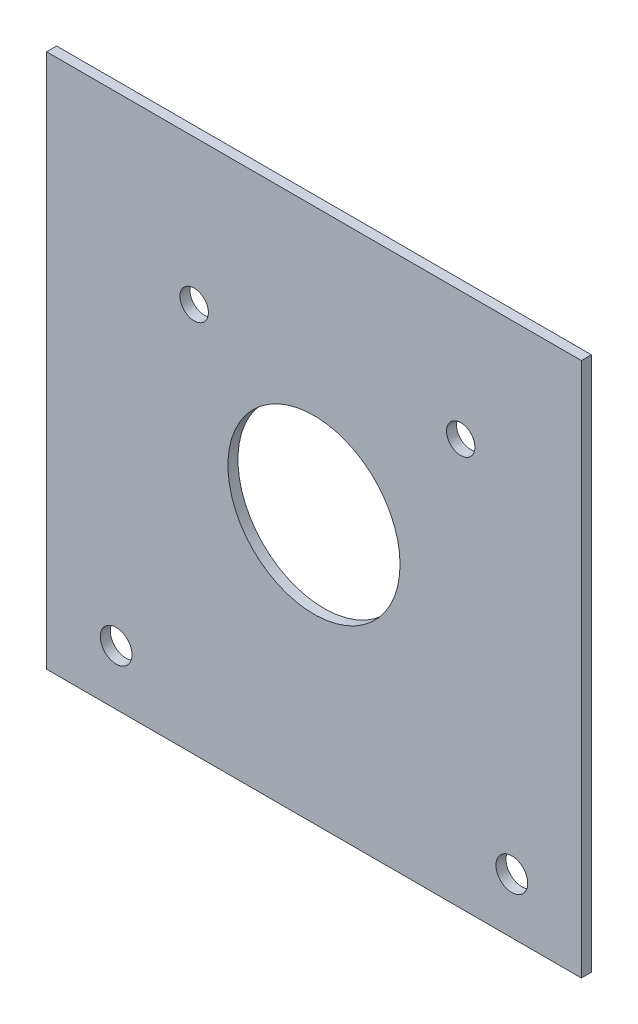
from build123d import *

# Parameters (mm, degrees)
SKETCH1_W           = 160
SKETCH1_H           = 160
SKETCH1_R           = 25.75
SKETCH1_R_2         = 4.25
SKETCH1_R_3         = 4.75
BOSS_EXTRUDE3_DEPTH = 3


with BuildPart() as part:
    # Sketch1 → Boss-Extrude3 (new body)
    with BuildSketch(Plane.XY):
        Rectangle(SKETCH1_W, SKETCH1_H)
        Circle(SKETCH1_R, mode=Mode.SUBTRACT)
        with Locations((43.9, 41.6)):
            Circle(SKETCH1_R_2, mode=Mode.SUBTRACT)
        with Locations((-35.85, 36.6)):
            Circle(SKETCH1_R_2, mode=Mode.SUBTRACT)
        with Locations((-59.2, -63.5)):
            Circle(SKETCH1_R_3, mode=Mode.SUBTRACT)
        with Locations((59.2, -63.5)):
            Circle(SKETCH1_R_3, mode=Mode.SUBTRACT)
    extrude(amount=BOSS_EXTRUDE3_DEPTH)


solid = part.part
